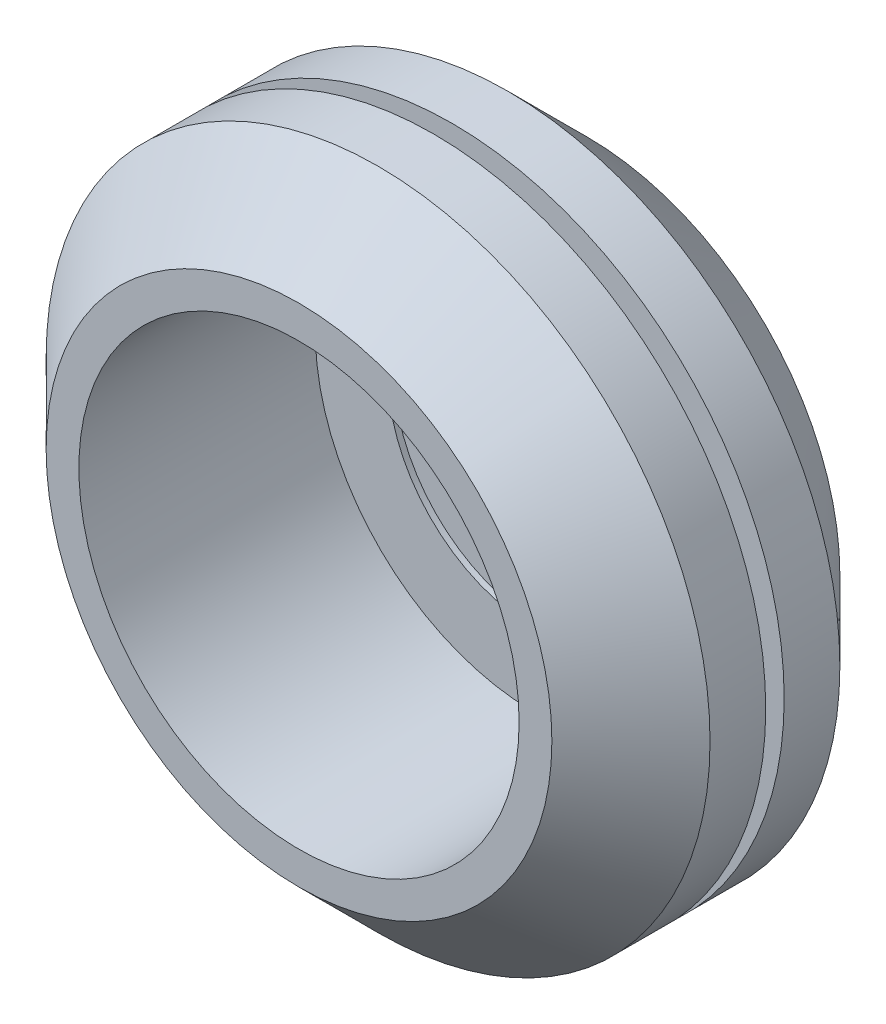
ISO-10303-21;
HEADER;
FILE_DESCRIPTION(('STEP AP214'),'2;1');
FILE_NAME('part.step','',(''),(''),'','','');
FILE_SCHEMA(('AUTOMOTIVE_DESIGN { 1 0 10303 214 1 1 1 1 }'));
ENDSEC;
DATA;
#1=APPLICATION_CONTEXT('core data for automotive mechanical design processes');
#2=APPLICATION_PROTOCOL_DEFINITION('international standard','automotive_design',2000,#1);
#3=PRODUCT_CONTEXT('',#1,'mechanical');
#4=PRODUCT('Part','Part','',(#3));
#5=PRODUCT_RELATED_PRODUCT_CATEGORY('part','',(#4));
#6=PRODUCT_DEFINITION_FORMATION('','',#4);
#7=PRODUCT_DEFINITION_CONTEXT('part definition',#1,'design');
#8=PRODUCT_DEFINITION('design','',#6,#7);
#9=PRODUCT_DEFINITION_SHAPE('','',#8);
#10=(LENGTH_UNIT() NAMED_UNIT(*) SI_UNIT(.MILLI.,.METRE.));
#11=(NAMED_UNIT(*) PLANE_ANGLE_UNIT() SI_UNIT($,.RADIAN.));
#12=(NAMED_UNIT(*) SI_UNIT($,.STERADIAN.) SOLID_ANGLE_UNIT());
#13=UNCERTAINTY_MEASURE_WITH_UNIT(LENGTH_MEASURE(1.E-05),#10,'distance_accuracy_value','');
#14=(GEOMETRIC_REPRESENTATION_CONTEXT(3) GLOBAL_UNCERTAINTY_ASSIGNED_CONTEXT((#13)) GLOBAL_UNIT_ASSIGNED_CONTEXT((#10,
#11,#12)) REPRESENTATION_CONTEXT('',''));
#15=CARTESIAN_POINT('',(0.,0.,0.));
#16=DIRECTION('',(0.,0.,1.));
#17=DIRECTION('',(1.,0.,0.));
#18=AXIS2_PLACEMENT_3D('',#15,#16,#17);
#19=CARTESIAN_POINT('',(0.,0.,-3.0988));
#20=DIRECTION('',(0.,0.,1.));
#21=DIRECTION('',(1.,0.,0.));
#22=AXIS2_PLACEMENT_3D('',#19,#20,#21);
#23=CONICAL_SURFACE('',#22,5.44195000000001,0.785398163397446);
#24=CARTESIAN_POINT('',(0.,0.,-1.397));
#25=DIRECTION('',(0.,0.,1.));
#26=DIRECTION('',(1.,0.,0.));
#27=AXIS2_PLACEMENT_3D('',#24,#25,#26);
#28=CIRCLE('',#27,7.14375);
#29=CARTESIAN_POINT('',(7.14375,0.,-1.397));
#30=VERTEX_POINT('',#29);
#31=EDGE_CURVE('E91',#30,#30,#28,.T.);
#32=ORIENTED_EDGE('',*,*,#31,.F.);
#33=EDGE_LOOP('',(#32));
#34=FACE_BOUND('',#33,.T.);
#35=CARTESIAN_POINT('',(0.,0.,-3.0988));
#36=DIRECTION('',(0.,0.,1.));
#37=DIRECTION('',(1.,0.,0.));
#38=AXIS2_PLACEMENT_3D('',#35,#36,#37);
#39=CIRCLE('',#38,5.44195000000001);
#40=CARTESIAN_POINT('',(5.44195000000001,0.,-3.0988));
#41=VERTEX_POINT('',#40);
#42=EDGE_CURVE('E10',#41,#41,#39,.T.);
#43=ORIENTED_EDGE('',*,*,#42,.T.);
#44=EDGE_LOOP('',(#43));
#45=FACE_BOUND('',#44,.T.);
#46=ADVANCED_FACE('F32',(#34,#45),#23,.T.);
#47=CARTESIAN_POINT('',(-5.44195000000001,0.,-3.0988));
#48=DIRECTION('',(0.,0.,1.));
#49=DIRECTION('',(1.,0.,0.));
#50=AXIS2_PLACEMENT_3D('',#47,#48,#49);
#51=PLANE('',#50);
#52=ORIENTED_EDGE('',*,*,#42,.F.);
#53=EDGE_LOOP('',(#52));
#54=FACE_BOUND('',#53,.T.);
#55=CARTESIAN_POINT('',(0.,0.,-3.0988));
#56=DIRECTION('',(0.,0.,1.));
#57=DIRECTION('',(1.,0.,0.));
#58=AXIS2_PLACEMENT_3D('',#55,#56,#57);
#59=CIRCLE('',#58,1.905);
#60=CARTESIAN_POINT('',(1.905,0.,-3.0988));
#61=VERTEX_POINT('',#60);
#62=EDGE_CURVE('E39',#61,#61,#59,.T.);
#63=ORIENTED_EDGE('',*,*,#62,.T.);
#64=EDGE_LOOP('',(#63));
#65=FACE_BOUND('',#64,.T.);
#66=ADVANCED_FACE('F99',(#54,#65),#51,.F.);
#67=CARTESIAN_POINT('',(0.,0.,0.));
#68=DIRECTION('',(0.,0.,1.));
#69=DIRECTION('',(1.,0.,0.));
#70=AXIS2_PLACEMENT_3D('',#67,#68,#69);
#71=CYLINDRICAL_SURFACE('',#70,1.905);
#72=ORIENTED_EDGE('',*,*,#62,.F.);
#73=EDGE_LOOP('',(#72));
#74=FACE_BOUND('',#73,.T.);
#75=CARTESIAN_POINT('',(0.,0.,-2.114600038));
#76=DIRECTION('',(0.,0.,1.));
#77=DIRECTION('',(1.,0.,0.));
#78=AXIS2_PLACEMENT_3D('',#75,#76,#77);
#79=CIRCLE('',#78,1.905);
#80=CARTESIAN_POINT('',(1.905,0.,-2.114600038));
#81=VERTEX_POINT('',#80);
#82=EDGE_CURVE('E46',#81,#81,#79,.T.);
#83=ORIENTED_EDGE('',*,*,#82,.T.);
#84=EDGE_LOOP('',(#83));
#85=FACE_BOUND('',#84,.T.);
#86=ADVANCED_FACE('F103',(#74,#85),#71,.F.);
#87=CARTESIAN_POINT('',(-3.175,0.,-2.114600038));
#88=DIRECTION('',(0.,0.,-1.));
#89=DIRECTION('',(-1.,0.,0.));
#90=AXIS2_PLACEMENT_3D('',#87,#88,#89);
#91=PLANE('',#90);
#92=ORIENTED_EDGE('',*,*,#82,.F.);
#93=EDGE_LOOP('',(#92));
#94=FACE_BOUND('',#93,.T.);
#95=CARTESIAN_POINT('',(0.,0.,-2.114600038));
#96=DIRECTION('',(0.,0.,1.));
#97=DIRECTION('',(1.,0.,0.));
#98=AXIS2_PLACEMENT_3D('',#95,#96,#97);
#99=CIRCLE('',#98,3.175);
#100=CARTESIAN_POINT('',(3.175,0.,-2.114600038));
#101=VERTEX_POINT('',#100);
#102=EDGE_CURVE('E50',#101,#101,#99,.T.);
#103=ORIENTED_EDGE('',*,*,#102,.T.);
#104=EDGE_LOOP('',(#103));
#105=FACE_BOUND('',#104,.T.);
#106=ADVANCED_FACE('F108',(#94,#105),#91,.F.);
#107=CARTESIAN_POINT('',(0.,0.,0.));
#108=DIRECTION('',(0.,0.,1.));
#109=DIRECTION('',(1.,0.,0.));
#110=AXIS2_PLACEMENT_3D('',#107,#108,#109);
#111=CYLINDRICAL_SURFACE('',#110,3.175);
#112=ORIENTED_EDGE('',*,*,#102,.F.);
#113=EDGE_LOOP('',(#112));
#114=FACE_BOUND('',#113,.T.);
#115=CARTESIAN_POINT('',(0.,0.,-1.987600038));
#116=DIRECTION('',(0.,0.,1.));
#117=DIRECTION('',(1.,0.,0.));
#118=AXIS2_PLACEMENT_3D('',#115,#116,#117);
#119=CIRCLE('',#118,3.175);
#120=CARTESIAN_POINT('',(3.175,0.,-1.987600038));
#121=VERTEX_POINT('',#120);
#122=EDGE_CURVE('E55',#121,#121,#119,.T.);
#123=ORIENTED_EDGE('',*,*,#122,.T.);
#124=EDGE_LOOP('',(#123));
#125=FACE_BOUND('',#124,.T.);
#126=ADVANCED_FACE('F114',(#114,#125),#111,.F.);
#127=CARTESIAN_POINT('',(-4.73710000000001,0.,-1.987600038));
#128=DIRECTION('',(0.,0.,-1.));
#129=DIRECTION('',(-1.,0.,0.));
#130=AXIS2_PLACEMENT_3D('',#127,#128,#129);
#131=PLANE('',#130);
#132=ORIENTED_EDGE('',*,*,#122,.F.);
#133=EDGE_LOOP('',(#132));
#134=FACE_BOUND('',#133,.T.);
#135=CARTESIAN_POINT('',(0.,0.,-1.987600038));
#136=DIRECTION('',(0.,0.,1.));
#137=DIRECTION('',(1.,0.,0.));
#138=AXIS2_PLACEMENT_3D('',#135,#136,#137);
#139=CIRCLE('',#138,4.7371);
#140=CARTESIAN_POINT('',(4.7371,0.,-1.987600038));
#141=VERTEX_POINT('',#140);
#142=EDGE_CURVE('E59',#141,#141,#139,.T.);
#143=ORIENTED_EDGE('',*,*,#142,.T.);
#144=EDGE_LOOP('',(#143));
#145=FACE_BOUND('',#144,.T.);
#146=ADVANCED_FACE('F118',(#134,#145),#131,.F.);
#147=CARTESIAN_POINT('',(0.,0.,0.));
#148=DIRECTION('',(0.,0.,1.));
#149=DIRECTION('',(1.,0.,0.));
#150=AXIS2_PLACEMENT_3D('',#147,#148,#149);
#151=CYLINDRICAL_SURFACE('',#150,4.7371);
#152=ORIENTED_EDGE('',*,*,#142,.F.);
#153=EDGE_LOOP('',(#152));
#154=FACE_BOUND('',#153,.T.);
#155=CARTESIAN_POINT('',(0.,0.,3.0988));
#156=DIRECTION('',(0.,0.,1.));
#157=DIRECTION('',(1.,0.,0.));
#158=AXIS2_PLACEMENT_3D('',#155,#156,#157);
#159=CIRCLE('',#158,4.7371);
#160=CARTESIAN_POINT('',(4.7371,0.,3.0988));
#161=VERTEX_POINT('',#160);
#162=EDGE_CURVE('E63',#161,#161,#159,.T.);
#163=ORIENTED_EDGE('',*,*,#162,.T.);
#164=EDGE_LOOP('',(#163));
#165=FACE_BOUND('',#164,.T.);
#166=ADVANCED_FACE('F122',(#154,#165),#151,.F.);
#167=CARTESIAN_POINT('',(-4.73709999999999,0.,3.0988));
#168=DIRECTION('',(0.,0.,-1.));
#169=DIRECTION('',(-1.,0.,0.));
#170=AXIS2_PLACEMENT_3D('',#167,#168,#169);
#171=PLANE('',#170);
#172=ORIENTED_EDGE('',*,*,#162,.F.);
#173=EDGE_LOOP('',(#172));
#174=FACE_BOUND('',#173,.T.);
#175=CARTESIAN_POINT('',(0.,0.,3.0988));
#176=DIRECTION('',(0.,0.,1.));
#177=DIRECTION('',(1.,0.,0.));
#178=AXIS2_PLACEMENT_3D('',#175,#176,#177);
#179=CIRCLE('',#178,5.44194999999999);
#180=CARTESIAN_POINT('',(5.44194999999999,0.,3.0988));
#181=VERTEX_POINT('',#180);
#182=EDGE_CURVE('E67',#181,#181,#179,.T.);
#183=ORIENTED_EDGE('',*,*,#182,.T.);
#184=EDGE_LOOP('',(#183));
#185=FACE_BOUND('',#184,.T.);
#186=ADVANCED_FACE('F126',(#174,#185),#171,.F.);
#187=CARTESIAN_POINT('',(0.,0.,1.397));
#188=DIRECTION('',(0.,0.,-1.));
#189=DIRECTION('',(-1.,0.,0.));
#190=AXIS2_PLACEMENT_3D('',#187,#188,#189);
#191=CONICAL_SURFACE('',#190,7.14375,0.78539816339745);
#192=ORIENTED_EDGE('',*,*,#182,.F.);
#193=EDGE_LOOP('',(#192));
#194=FACE_BOUND('',#193,.T.);
#195=CARTESIAN_POINT('',(0.,0.,1.397));
#196=DIRECTION('',(0.,0.,1.));
#197=DIRECTION('',(1.,0.,0.));
#198=AXIS2_PLACEMENT_3D('',#195,#196,#197);
#199=CIRCLE('',#198,7.14375);
#200=CARTESIAN_POINT('',(7.14375,0.,1.397));
#201=VERTEX_POINT('',#200);
#202=EDGE_CURVE('E71',#201,#201,#199,.T.);
#203=ORIENTED_EDGE('',*,*,#202,.T.);
#204=EDGE_LOOP('',(#203));
#205=FACE_BOUND('',#204,.T.);
#206=ADVANCED_FACE('F130',(#194,#205),#191,.T.);
#207=CARTESIAN_POINT('',(0.,0.,0.));
#208=DIRECTION('',(0.,0.,1.));
#209=DIRECTION('',(1.,0.,0.));
#210=AXIS2_PLACEMENT_3D('',#207,#208,#209);
#211=CYLINDRICAL_SURFACE('',#210,7.14375);
#212=ORIENTED_EDGE('',*,*,#202,.F.);
#213=EDGE_LOOP('',(#212));
#214=FACE_BOUND('',#213,.T.);
#215=CARTESIAN_POINT('',(0.,0.,0.198437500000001));
#216=DIRECTION('',(0.,0.,1.));
#217=DIRECTION('',(1.,0.,0.));
#218=AXIS2_PLACEMENT_3D('',#215,#216,#217);
#219=CIRCLE('',#218,7.14375);
#220=CARTESIAN_POINT('',(7.14375,0.,0.198437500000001));
#221=VERTEX_POINT('',#220);
#222=EDGE_CURVE('E75',#221,#221,#219,.T.);
#223=ORIENTED_EDGE('',*,*,#222,.T.);
#224=EDGE_LOOP('',(#223));
#225=FACE_BOUND('',#224,.T.);
#226=ADVANCED_FACE('F134',(#214,#225),#211,.T.);
#227=CARTESIAN_POINT('',(-7.14375,0.,0.198437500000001));
#228=DIRECTION('',(0.,0.,1.));
#229=DIRECTION('',(1.,0.,0.));
#230=AXIS2_PLACEMENT_3D('',#227,#228,#229);
#231=PLANE('',#230);
#232=ORIENTED_EDGE('',*,*,#222,.F.);
#233=EDGE_LOOP('',(#232));
#234=FACE_BOUND('',#233,.T.);
#235=CARTESIAN_POINT('',(0.,0.,0.198437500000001));
#236=DIRECTION('',(0.,0.,1.));
#237=DIRECTION('',(1.,0.,0.));
#238=AXIS2_PLACEMENT_3D('',#235,#236,#237);
#239=CIRCLE('',#238,6.35);
#240=CARTESIAN_POINT('',(6.35,0.,0.198437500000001));
#241=VERTEX_POINT('',#240);
#242=EDGE_CURVE('E79',#241,#241,#239,.T.);
#243=ORIENTED_EDGE('',*,*,#242,.T.);
#244=EDGE_LOOP('',(#243));
#245=FACE_BOUND('',#244,.T.);
#246=ADVANCED_FACE('F138',(#234,#245),#231,.F.);
#247=CARTESIAN_POINT('',(0.,0.,0.));
#248=DIRECTION('',(0.,0.,1.));
#249=DIRECTION('',(1.,0.,0.));
#250=AXIS2_PLACEMENT_3D('',#247,#248,#249);
#251=TOROIDAL_SURFACE('',#250,6.35,0.1984375);
#252=ORIENTED_EDGE('',*,*,#242,.F.);
#253=EDGE_LOOP('',(#252));
#254=FACE_BOUND('',#253,.T.);
#255=CARTESIAN_POINT('',(0.,0.,-0.198437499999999));
#256=DIRECTION('',(0.,0.,1.));
#257=DIRECTION('',(1.,0.,0.));
#258=AXIS2_PLACEMENT_3D('',#255,#256,#257);
#259=CIRCLE('',#258,6.35);
#260=CARTESIAN_POINT('',(6.35,0.,-0.198437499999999));
#261=VERTEX_POINT('',#260);
#262=EDGE_CURVE('E83',#261,#261,#259,.T.);
#263=ORIENTED_EDGE('',*,*,#262,.T.);
#264=EDGE_LOOP('',(#263));
#265=FACE_BOUND('',#264,.T.);
#266=ADVANCED_FACE('F142',(#254,#265),#251,.F.);
#267=CARTESIAN_POINT('',(-7.14375,0.,-0.198437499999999));
#268=DIRECTION('',(0.,0.,-1.));
#269=DIRECTION('',(-1.,0.,0.));
#270=AXIS2_PLACEMENT_3D('',#267,#268,#269);
#271=PLANE('',#270);
#272=ORIENTED_EDGE('',*,*,#262,.F.);
#273=EDGE_LOOP('',(#272));
#274=FACE_BOUND('',#273,.T.);
#275=CARTESIAN_POINT('',(0.,0.,-0.198437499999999));
#276=DIRECTION('',(0.,0.,1.));
#277=DIRECTION('',(1.,0.,0.));
#278=AXIS2_PLACEMENT_3D('',#275,#276,#277);
#279=CIRCLE('',#278,7.14375);
#280=CARTESIAN_POINT('',(7.14375,0.,-0.198437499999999));
#281=VERTEX_POINT('',#280);
#282=EDGE_CURVE('E87',#281,#281,#279,.T.);
#283=ORIENTED_EDGE('',*,*,#282,.T.);
#284=EDGE_LOOP('',(#283));
#285=FACE_BOUND('',#284,.T.);
#286=ADVANCED_FACE('F146',(#274,#285),#271,.F.);
#287=CARTESIAN_POINT('',(0.,0.,0.));
#288=DIRECTION('',(0.,0.,1.));
#289=DIRECTION('',(1.,0.,0.));
#290=AXIS2_PLACEMENT_3D('',#287,#288,#289);
#291=CYLINDRICAL_SURFACE('',#290,7.14375);
#292=ORIENTED_EDGE('',*,*,#282,.F.);
#293=EDGE_LOOP('',(#292));
#294=FACE_BOUND('',#293,.T.);
#295=ORIENTED_EDGE('',*,*,#31,.T.);
#296=EDGE_LOOP('',(#295));
#297=FACE_BOUND('',#296,.T.);
#298=ADVANCED_FACE('F96',(#294,#297),#291,.T.);
#299=CLOSED_SHELL('',(#46,#66,#86,#106,#126,#146,#166,#186,#206,#226,#246,#266,#286,#298));
#300=MANIFOLD_SOLID_BREP('B2',#299);
#301=ADVANCED_BREP_SHAPE_REPRESENTATION('',(#18,#300),#14);
#302=SHAPE_DEFINITION_REPRESENTATION(#9,#301);
ENDSEC;
END-ISO-10303-21;
